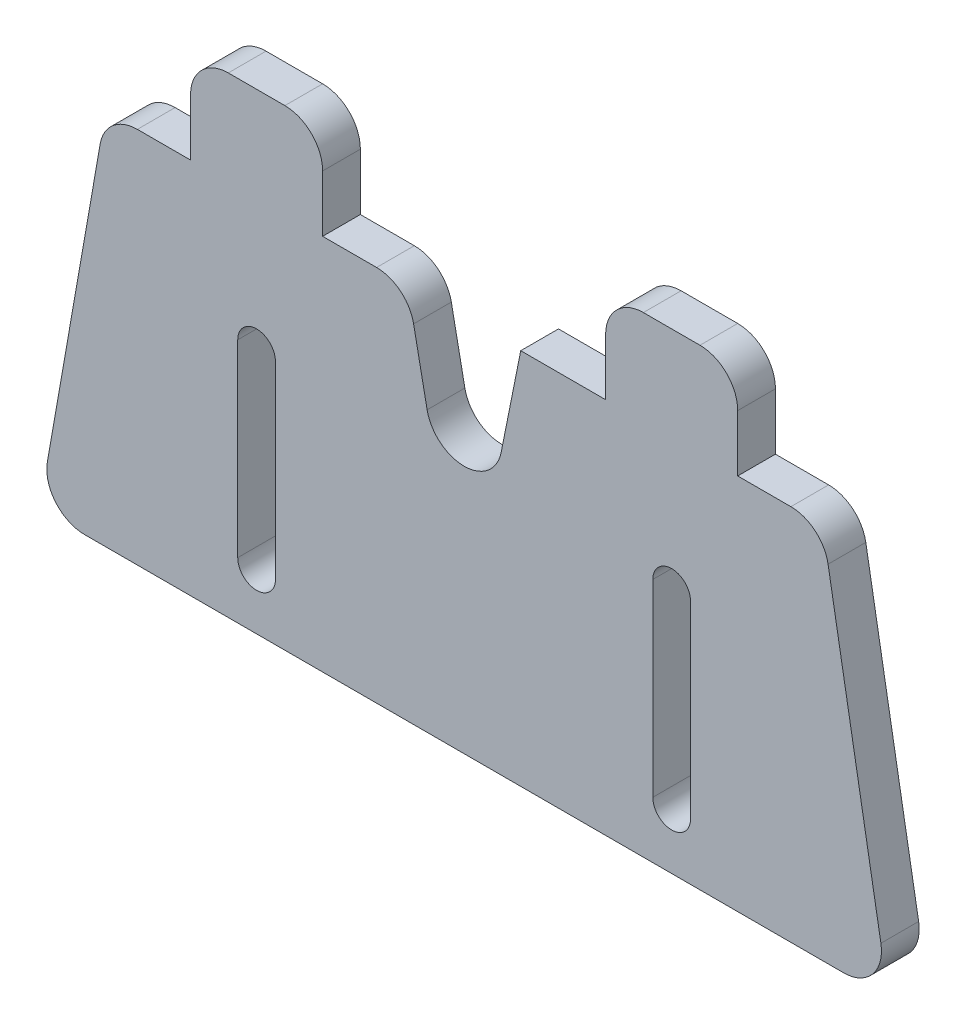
ISO-10303-21;
HEADER;
FILE_DESCRIPTION(('STEP AP214'),'2;1');
FILE_NAME('part.step','',(''),(''),'','','');
FILE_SCHEMA(('AUTOMOTIVE_DESIGN { 1 0 10303 214 1 1 1 1 }'));
ENDSEC;
DATA;
#1=APPLICATION_CONTEXT('core data for automotive mechanical design processes');
#2=APPLICATION_PROTOCOL_DEFINITION('international standard','automotive_design',2000,#1);
#3=PRODUCT_CONTEXT('',#1,'mechanical');
#4=PRODUCT('Part','Part','',(#3));
#5=PRODUCT_RELATED_PRODUCT_CATEGORY('part','',(#4));
#6=PRODUCT_DEFINITION_FORMATION('','',#4);
#7=PRODUCT_DEFINITION_CONTEXT('part definition',#1,'design');
#8=PRODUCT_DEFINITION('design','',#6,#7);
#9=PRODUCT_DEFINITION_SHAPE('','',#8);
#10=(LENGTH_UNIT() NAMED_UNIT(*) SI_UNIT(.MILLI.,.METRE.));
#11=(NAMED_UNIT(*) PLANE_ANGLE_UNIT() SI_UNIT($,.RADIAN.));
#12=(NAMED_UNIT(*) SI_UNIT($,.STERADIAN.) SOLID_ANGLE_UNIT());
#13=UNCERTAINTY_MEASURE_WITH_UNIT(LENGTH_MEASURE(1.E-05),#10,'distance_accuracy_value','');
#14=(GEOMETRIC_REPRESENTATION_CONTEXT(3) GLOBAL_UNCERTAINTY_ASSIGNED_CONTEXT((#13)) GLOBAL_UNIT_ASSIGNED_CONTEXT((#10,
#11,#12)) REPRESENTATION_CONTEXT('',''));
#15=CARTESIAN_POINT('',(0.,0.,0.));
#16=DIRECTION('',(0.,0.,1.));
#17=DIRECTION('',(1.,0.,0.));
#18=AXIS2_PLACEMENT_3D('',#15,#16,#17);
#19=CARTESIAN_POINT('',(12.,0.,2.));
#20=DIRECTION('',(1.,0.,0.));
#21=DIRECTION('',(0.,0.,-1.));
#22=AXIS2_PLACEMENT_3D('',#19,#20,#21);
#23=PLANE('',#22);
#24=DIRECTION('',(0.,-1.,0.));
#25=VECTOR('',#24,1.);
#26=CARTESIAN_POINT('',(12.,0.,0.));
#27=LINE('',#26,#25);
#28=CARTESIAN_POINT('',(12.,0.5,0.));
#29=VERTEX_POINT('',#28);
#30=CARTESIAN_POINT('',(12.,-9.5,0.));
#31=VERTEX_POINT('',#30);
#32=EDGE_CURVE('E381',#29,#31,#27,.T.);
#33=ORIENTED_EDGE('',*,*,#32,.T.);
#34=DIRECTION('',(0.,0.,-1.));
#35=VECTOR('',#34,1.);
#36=CARTESIAN_POINT('',(12.,-9.5,2.));
#37=LINE('',#36,#35);
#38=CARTESIAN_POINT('',(12.,-9.5,2.));
#39=VERTEX_POINT('',#38);
#40=EDGE_CURVE('E400',#39,#31,#37,.T.);
#41=ORIENTED_EDGE('',*,*,#40,.F.);
#42=DIRECTION('',(0.,-1.,0.));
#43=VECTOR('',#42,1.);
#44=CARTESIAN_POINT('',(12.,0.,2.));
#45=LINE('',#44,#43);
#46=CARTESIAN_POINT('',(12.,0.5,2.));
#47=VERTEX_POINT('',#46);
#48=EDGE_CURVE('E321',#47,#39,#45,.T.);
#49=ORIENTED_EDGE('',*,*,#48,.F.);
#50=DIRECTION('',(0.,0.,-1.));
#51=VECTOR('',#50,1.);
#52=CARTESIAN_POINT('',(12.,0.5,2.));
#53=LINE('',#52,#51);
#54=EDGE_CURVE('E392',#47,#29,#53,.T.);
#55=ORIENTED_EDGE('',*,*,#54,.T.);
#56=EDGE_LOOP('',(#33,#41,#49,#55));
#57=FACE_BOUND('',#56,.T.);
#58=ADVANCED_FACE('F34',(#57),#23,.F.);
#59=CARTESIAN_POINT('',(11.,-9.5,2.));
#60=DIRECTION('',(0.,0.,-1.));
#61=DIRECTION('',(-1.,0.,0.));
#62=AXIS2_PLACEMENT_3D('',#59,#60,#61);
#63=CYLINDRICAL_SURFACE('',#62,1.);
#64=CARTESIAN_POINT('',(11.,-9.5,0.));
#65=DIRECTION('',(0.,0.,1.));
#66=DIRECTION('',(1.,0.,0.));
#67=AXIS2_PLACEMENT_3D('',#64,#65,#66);
#68=CIRCLE('',#67,1.);
#69=CARTESIAN_POINT('',(10.,-9.5,0.));
#70=VERTEX_POINT('',#69);
#71=EDGE_CURVE('E384',#31,#70,#68,.F.);
#72=ORIENTED_EDGE('',*,*,#71,.T.);
#73=DIRECTION('',(0.,0.,-1.));
#74=VECTOR('',#73,1.);
#75=CARTESIAN_POINT('',(10.,-9.5,2.));
#76=LINE('',#75,#74);
#77=CARTESIAN_POINT('',(10.,-9.5,2.));
#78=VERTEX_POINT('',#77);
#79=EDGE_CURVE('E398',#78,#70,#76,.T.);
#80=ORIENTED_EDGE('',*,*,#79,.F.);
#81=CARTESIAN_POINT('',(11.,-9.5,2.));
#82=DIRECTION('',(0.,0.,1.));
#83=DIRECTION('',(1.,0.,0.));
#84=AXIS2_PLACEMENT_3D('',#81,#82,#83);
#85=CIRCLE('',#84,1.);
#86=EDGE_CURVE('E324',#39,#78,#85,.F.);
#87=ORIENTED_EDGE('',*,*,#86,.F.);
#88=ORIENTED_EDGE('',*,*,#40,.T.);
#89=EDGE_LOOP('',(#72,#80,#87,#88));
#90=FACE_BOUND('',#89,.T.);
#91=ADVANCED_FACE('F588',(#90),#63,.F.);
#92=CARTESIAN_POINT('',(10.,0.,2.));
#93=DIRECTION('',(1.,0.,0.));
#94=DIRECTION('',(0.,0.,-1.));
#95=AXIS2_PLACEMENT_3D('',#92,#93,#94);
#96=PLANE('',#95);
#97=DIRECTION('',(0.,-1.,0.));
#98=VECTOR('',#97,1.);
#99=CARTESIAN_POINT('',(10.,0.,0.));
#100=LINE('',#99,#98);
#101=CARTESIAN_POINT('',(10.,0.5,0.));
#102=VERTEX_POINT('',#101);
#103=EDGE_CURVE('E387',#102,#70,#100,.T.);
#104=ORIENTED_EDGE('',*,*,#103,.F.);
#105=DIRECTION('',(0.,0.,-1.));
#106=VECTOR('',#105,1.);
#107=CARTESIAN_POINT('',(10.,0.5,2.));
#108=LINE('',#107,#106);
#109=CARTESIAN_POINT('',(10.,0.5,2.));
#110=VERTEX_POINT('',#109);
#111=EDGE_CURVE('E395',#110,#102,#108,.T.);
#112=ORIENTED_EDGE('',*,*,#111,.F.);
#113=DIRECTION('',(0.,-1.,0.));
#114=VECTOR('',#113,1.);
#115=CARTESIAN_POINT('',(10.,0.,2.));
#116=LINE('',#115,#114);
#117=EDGE_CURVE('E326',#110,#78,#116,.T.);
#118=ORIENTED_EDGE('',*,*,#117,.T.);
#119=ORIENTED_EDGE('',*,*,#79,.T.);
#120=EDGE_LOOP('',(#104,#112,#118,#119));
#121=FACE_BOUND('',#120,.T.);
#122=ADVANCED_FACE('F594',(#121),#96,.T.);
#123=CARTESIAN_POINT('',(-11.,-9.5,2.));
#124=DIRECTION('',(0.,0.,-1.));
#125=DIRECTION('',(-1.,0.,0.));
#126=AXIS2_PLACEMENT_3D('',#123,#124,#125);
#127=CYLINDRICAL_SURFACE('',#126,1.);
#128=CARTESIAN_POINT('',(-11.,-9.5,0.));
#129=DIRECTION('',(0.,0.,1.));
#130=DIRECTION('',(1.,0.,0.));
#131=AXIS2_PLACEMENT_3D('',#128,#129,#130);
#132=CIRCLE('',#131,1.);
#133=CARTESIAN_POINT('',(-12.,-9.5,0.));
#134=VERTEX_POINT('',#133);
#135=CARTESIAN_POINT('',(-10.,-9.5,0.));
#136=VERTEX_POINT('',#135);
#137=EDGE_CURVE('E369',#134,#136,#132,.T.);
#138=ORIENTED_EDGE('',*,*,#137,.F.);
#139=DIRECTION('',(0.,0.,-1.));
#140=VECTOR('',#139,1.);
#141=CARTESIAN_POINT('',(-12.,-9.5,2.));
#142=LINE('',#141,#140);
#143=CARTESIAN_POINT('',(-12.,-9.5,2.));
#144=VERTEX_POINT('',#143);
#145=EDGE_CURVE('E396',#144,#134,#142,.T.);
#146=ORIENTED_EDGE('',*,*,#145,.F.);
#147=CARTESIAN_POINT('',(-11.,-9.5,2.));
#148=DIRECTION('',(0.,0.,1.));
#149=DIRECTION('',(1.,0.,0.));
#150=AXIS2_PLACEMENT_3D('',#147,#148,#149);
#151=CIRCLE('',#150,1.);
#152=CARTESIAN_POINT('',(-10.,-9.5,2.));
#153=VERTEX_POINT('',#152);
#154=EDGE_CURVE('E310',#144,#153,#151,.T.);
#155=ORIENTED_EDGE('',*,*,#154,.T.);
#156=DIRECTION('',(0.,0.,-1.));
#157=VECTOR('',#156,1.);
#158=CARTESIAN_POINT('',(-10.,-9.5,2.));
#159=LINE('',#158,#157);
#160=EDGE_CURVE('E262',#153,#136,#159,.T.);
#161=ORIENTED_EDGE('',*,*,#160,.T.);
#162=EDGE_LOOP('',(#138,#146,#155,#161));
#163=FACE_BOUND('',#162,.T.);
#164=ADVANCED_FACE('F611',(#163),#127,.F.);
#165=CARTESIAN_POINT('',(-12.,0.,2.));
#166=DIRECTION('',(1.,0.,0.));
#167=DIRECTION('',(0.,0.,-1.));
#168=AXIS2_PLACEMENT_3D('',#165,#166,#167);
#169=PLANE('',#168);
#170=DIRECTION('',(0.,-1.,0.));
#171=VECTOR('',#170,1.);
#172=CARTESIAN_POINT('',(-12.,0.,0.));
#173=LINE('',#172,#171);
#174=CARTESIAN_POINT('',(-12.,0.5,0.));
#175=VERTEX_POINT('',#174);
#176=EDGE_CURVE('E372',#175,#134,#173,.T.);
#177=ORIENTED_EDGE('',*,*,#176,.F.);
#178=DIRECTION('',(0.,0.,-1.));
#179=VECTOR('',#178,1.);
#180=CARTESIAN_POINT('',(-12.,0.5,2.));
#181=LINE('',#180,#179);
#182=CARTESIAN_POINT('',(-12.,0.5,2.));
#183=VERTEX_POINT('',#182);
#184=EDGE_CURVE('E407',#183,#175,#181,.T.);
#185=ORIENTED_EDGE('',*,*,#184,.F.);
#186=DIRECTION('',(0.,-1.,0.));
#187=VECTOR('',#186,1.);
#188=CARTESIAN_POINT('',(-12.,0.,2.));
#189=LINE('',#188,#187);
#190=EDGE_CURVE('E313',#183,#144,#189,.T.);
#191=ORIENTED_EDGE('',*,*,#190,.T.);
#192=ORIENTED_EDGE('',*,*,#145,.T.);
#193=EDGE_LOOP('',(#177,#185,#191,#192));
#194=FACE_BOUND('',#193,.T.);
#195=ADVANCED_FACE('F607',(#194),#169,.T.);
#196=CARTESIAN_POINT('',(-11.,0.5,2.));
#197=DIRECTION('',(0.,0.,-1.));
#198=DIRECTION('',(-1.,0.,0.));
#199=AXIS2_PLACEMENT_3D('',#196,#197,#198);
#200=CYLINDRICAL_SURFACE('',#199,1.);
#201=CARTESIAN_POINT('',(-11.,0.5,0.));
#202=DIRECTION('',(0.,0.,1.));
#203=DIRECTION('',(1.,0.,0.));
#204=AXIS2_PLACEMENT_3D('',#201,#202,#203);
#205=CIRCLE('',#204,1.);
#206=CARTESIAN_POINT('',(-10.,0.5,0.));
#207=VERTEX_POINT('',#206);
#208=EDGE_CURVE('E375',#207,#175,#205,.T.);
#209=ORIENTED_EDGE('',*,*,#208,.F.);
#210=DIRECTION('',(0.,0.,-1.));
#211=VECTOR('',#210,1.);
#212=CARTESIAN_POINT('',(-10.,0.5,2.));
#213=LINE('',#212,#211);
#214=CARTESIAN_POINT('',(-10.,0.5,2.));
#215=VERTEX_POINT('',#214);
#216=EDGE_CURVE('E405',#215,#207,#213,.T.);
#217=ORIENTED_EDGE('',*,*,#216,.F.);
#218=CARTESIAN_POINT('',(-11.,0.5,2.));
#219=DIRECTION('',(0.,0.,1.));
#220=DIRECTION('',(1.,0.,0.));
#221=AXIS2_PLACEMENT_3D('',#218,#219,#220);
#222=CIRCLE('',#221,1.);
#223=EDGE_CURVE('E316',#215,#183,#222,.T.);
#224=ORIENTED_EDGE('',*,*,#223,.T.);
#225=ORIENTED_EDGE('',*,*,#184,.T.);
#226=EDGE_LOOP('',(#209,#217,#224,#225));
#227=FACE_BOUND('',#226,.T.);
#228=ADVANCED_FACE('F604',(#227),#200,.F.);
#229=CARTESIAN_POINT('',(0.,-12.5,2.));
#230=DIRECTION('',(0.,1.,0.));
#231=DIRECTION('',(0.,0.,1.));
#232=AXIS2_PLACEMENT_3D('',#229,#230,#231);
#233=PLANE('',#232);
#234=DIRECTION('',(1.,0.,0.));
#235=VECTOR('',#234,1.);
#236=CARTESIAN_POINT('',(0.,-12.5,0.));
#237=LINE('',#236,#235);
#238=CARTESIAN_POINT('',(-20.1196059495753,-12.5,0.));
#239=VERTEX_POINT('',#238);
#240=CARTESIAN_POINT('',(20.1196059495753,-12.5,0.));
#241=VERTEX_POINT('',#240);
#242=EDGE_CURVE('E332',#239,#241,#237,.T.);
#243=ORIENTED_EDGE('',*,*,#242,.T.);
#244=DIRECTION('',(0.,0.,-1.));
#245=VECTOR('',#244,1.);
#246=CARTESIAN_POINT('',(20.1196059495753,-12.5,2.));
#247=LINE('',#246,#245);
#248=CARTESIAN_POINT('',(20.1196059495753,-12.5,2.));
#249=VERTEX_POINT('',#248);
#250=EDGE_CURVE('E444',#241,#249,#247,.F.);
#251=ORIENTED_EDGE('',*,*,#250,.T.);
#252=DIRECTION('',(1.,0.,0.));
#253=VECTOR('',#252,1.);
#254=CARTESIAN_POINT('',(0.,-12.5,2.));
#255=LINE('',#254,#253);
#256=CARTESIAN_POINT('',(-20.1196059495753,-12.5,2.));
#257=VERTEX_POINT('',#256);
#258=EDGE_CURVE('E281',#257,#249,#255,.T.);
#259=ORIENTED_EDGE('',*,*,#258,.F.);
#260=DIRECTION('',(0.,0.,-1.));
#261=VECTOR('',#260,1.);
#262=CARTESIAN_POINT('',(-20.1196059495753,-12.5,0.));
#263=LINE('',#262,#261);
#264=EDGE_CURVE('E441',#257,#239,#263,.T.);
#265=ORIENTED_EDGE('',*,*,#264,.T.);
#266=EDGE_LOOP('',(#243,#251,#259,#265));
#267=FACE_BOUND('',#266,.T.);
#268=ADVANCED_FACE('F564',(#267),#233,.F.);
#269=CARTESIAN_POINT('',(19.7089144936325,3.44906003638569,2.));
#270=DIRECTION('',(-0.985030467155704,-0.172380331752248,0.));
#271=DIRECTION('',(0.172380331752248,-0.985030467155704,0.));
#272=AXIS2_PLACEMENT_3D('',#269,#270,#271);
#273=PLANE('',#272);
#274=DIRECTION('',(-0.172380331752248,0.985030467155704,0.));
#275=VECTOR('',#274,1.);
#276=CARTESIAN_POINT('',(19.7089144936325,3.44906003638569,2.));
#277=LINE('',#276,#275);
#278=CARTESIAN_POINT('',(22.0896668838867,-10.1552393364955,2.));
#279=VERTEX_POINT('',#278);
#280=CARTESIAN_POINT('',(19.2896668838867,5.8447606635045,2.));
#281=VERTEX_POINT('',#280);
#282=EDGE_CURVE('E279',#279,#281,#277,.T.);
#283=ORIENTED_EDGE('',*,*,#282,.F.);
#284=DIRECTION('',(0.,0.,-1.));
#285=VECTOR('',#284,1.);
#286=CARTESIAN_POINT('',(22.0896668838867,-10.1552393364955,2.));
#287=LINE('',#286,#285);
#288=CARTESIAN_POINT('',(22.0896668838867,-10.1552393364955,0.));
#289=VERTEX_POINT('',#288);
#290=EDGE_CURVE('E420',#279,#289,#287,.T.);
#291=ORIENTED_EDGE('',*,*,#290,.T.);
#292=DIRECTION('',(-0.172380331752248,0.985030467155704,0.));
#293=VECTOR('',#292,1.);
#294=CARTESIAN_POINT('',(19.7089144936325,3.44906003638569,0.));
#295=LINE('',#294,#293);
#296=CARTESIAN_POINT('',(19.2896668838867,5.8447606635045,0.));
#297=VERTEX_POINT('',#296);
#298=EDGE_CURVE('E335',#289,#297,#295,.T.);
#299=ORIENTED_EDGE('',*,*,#298,.T.);
#300=DIRECTION('',(0.,0.,-1.));
#301=VECTOR('',#300,1.);
#302=CARTESIAN_POINT('',(19.2896668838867,5.8447606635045,2.));
#303=LINE('',#302,#301);
#304=EDGE_CURVE('E403',#297,#281,#303,.F.);
#305=ORIENTED_EDGE('',*,*,#304,.T.);
#306=EDGE_LOOP('',(#283,#291,#299,#305));
#307=FACE_BOUND('',#306,.T.);
#308=ADVANCED_FACE('F572',(#307),#273,.F.);
#309=CARTESIAN_POINT('',(0.,7.5,2.));
#310=DIRECTION('',(0.,1.,0.));
#311=DIRECTION('',(-1.,0.,0.));
#312=AXIS2_PLACEMENT_3D('',#309,#310,#311);
#313=PLANE('',#312);
#314=DIRECTION('',(1.,0.,0.));
#315=VECTOR('',#314,1.);
#316=CARTESIAN_POINT('',(0.,7.5,2.));
#317=LINE('',#316,#315);
#318=CARTESIAN_POINT('',(14.5,7.5,2.));
#319=VERTEX_POINT('',#318);
#320=CARTESIAN_POINT('',(17.3196059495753,7.5,2.));
#321=VERTEX_POINT('',#320);
#322=EDGE_CURVE('E255',#319,#321,#317,.T.);
#323=ORIENTED_EDGE('',*,*,#322,.T.);
#324=DIRECTION('',(0.,0.,-1.));
#325=VECTOR('',#324,1.);
#326=CARTESIAN_POINT('',(17.3196059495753,7.5,0.));
#327=LINE('',#326,#325);
#328=CARTESIAN_POINT('',(17.3196059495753,7.5,0.));
#329=VERTEX_POINT('',#328);
#330=EDGE_CURVE('E478',#321,#329,#327,.T.);
#331=ORIENTED_EDGE('',*,*,#330,.T.);
#332=DIRECTION('',(1.,0.,0.));
#333=VECTOR('',#332,1.);
#334=CARTESIAN_POINT('',(0.,7.5,0.));
#335=LINE('',#334,#333);
#336=CARTESIAN_POINT('',(14.5,7.5,0.));
#337=VERTEX_POINT('',#336);
#338=EDGE_CURVE('E258',#337,#329,#335,.T.);
#339=ORIENTED_EDGE('',*,*,#338,.F.);
#340=DIRECTION('',(0.,0.,-1.));
#341=VECTOR('',#340,1.);
#342=CARTESIAN_POINT('',(14.5,7.5,2.));
#343=LINE('',#342,#341);
#344=EDGE_CURVE('E250',#319,#337,#343,.T.);
#345=ORIENTED_EDGE('',*,*,#344,.F.);
#346=EDGE_LOOP('',(#323,#331,#339,#345));
#347=FACE_BOUND('',#346,.T.);
#348=ADVANCED_FACE('F252',(#347),#313,.T.);
#349=CARTESIAN_POINT('',(14.5,0.,2.));
#350=DIRECTION('',(-1.,0.,0.));
#351=DIRECTION('',(0.,0.,1.));
#352=AXIS2_PLACEMENT_3D('',#349,#350,#351);
#353=PLANE('',#352);
#354=DIRECTION('',(0.,1.,0.));
#355=VECTOR('',#354,1.);
#356=CARTESIAN_POINT('',(14.5,0.,0.));
#357=LINE('',#356,#355);
#358=CARTESIAN_POINT('',(14.5,10.5,0.));
#359=VERTEX_POINT('',#358);
#360=EDGE_CURVE('E339',#337,#359,#357,.T.);
#361=ORIENTED_EDGE('',*,*,#360,.T.);
#362=DIRECTION('',(0.,0.,-1.));
#363=VECTOR('',#362,1.);
#364=CARTESIAN_POINT('',(14.5,10.5,2.));
#365=LINE('',#364,#363);
#366=CARTESIAN_POINT('',(14.5,10.5,2.));
#367=VERTEX_POINT('',#366);
#368=EDGE_CURVE('E269',#359,#367,#365,.F.);
#369=ORIENTED_EDGE('',*,*,#368,.T.);
#370=DIRECTION('',(0.,1.,0.));
#371=VECTOR('',#370,1.);
#372=CARTESIAN_POINT('',(14.5,0.,2.));
#373=LINE('',#372,#371);
#374=EDGE_CURVE('E266',#319,#367,#373,.T.);
#375=ORIENTED_EDGE('',*,*,#374,.F.);
#376=ORIENTED_EDGE('',*,*,#344,.T.);
#377=EDGE_LOOP('',(#361,#369,#375,#376));
#378=FACE_BOUND('',#377,.T.);
#379=ADVANCED_FACE('F267',(#378),#353,.F.);
#380=CARTESIAN_POINT('',(0.,12.5,2.));
#381=DIRECTION('',(0.,1.,0.));
#382=DIRECTION('',(0.,0.,1.));
#383=AXIS2_PLACEMENT_3D('',#380,#381,#382);
#384=PLANE('',#383);
#385=DIRECTION('',(1.,0.,0.));
#386=VECTOR('',#385,1.);
#387=CARTESIAN_POINT('',(0.,12.5,2.));
#388=LINE('',#387,#386);
#389=CARTESIAN_POINT('',(9.5,12.5,2.));
#390=VERTEX_POINT('',#389);
#391=CARTESIAN_POINT('',(12.5,12.5,2.));
#392=VERTEX_POINT('',#391);
#393=EDGE_CURVE('E271',#390,#392,#388,.T.);
#394=ORIENTED_EDGE('',*,*,#393,.T.);
#395=DIRECTION('',(0.,0.,-1.));
#396=VECTOR('',#395,1.);
#397=CARTESIAN_POINT('',(12.5,12.5,0.));
#398=LINE('',#397,#396);
#399=CARTESIAN_POINT('',(12.5,12.5,0.));
#400=VERTEX_POINT('',#399);
#401=EDGE_CURVE('E482',#392,#400,#398,.T.);
#402=ORIENTED_EDGE('',*,*,#401,.T.);
#403=DIRECTION('',(1.,0.,0.));
#404=VECTOR('',#403,1.);
#405=CARTESIAN_POINT('',(0.,12.5,0.));
#406=LINE('',#405,#404);
#407=CARTESIAN_POINT('',(9.5,12.5,0.));
#408=VERTEX_POINT('',#407);
#409=EDGE_CURVE('E341',#408,#400,#406,.T.);
#410=ORIENTED_EDGE('',*,*,#409,.F.);
#411=DIRECTION('',(0.,0.,-1.));
#412=VECTOR('',#411,1.);
#413=CARTESIAN_POINT('',(9.5,12.5,2.));
#414=LINE('',#413,#412);
#415=EDGE_CURVE('E480',#408,#390,#414,.F.);
#416=ORIENTED_EDGE('',*,*,#415,.T.);
#417=EDGE_LOOP('',(#394,#402,#410,#416));
#418=FACE_BOUND('',#417,.T.);
#419=ADVANCED_FACE('F625',(#418),#384,.T.);
#420=CARTESIAN_POINT('',(7.5,0.,2.));
#421=DIRECTION('',(1.,0.,0.));
#422=DIRECTION('',(0.,0.,-1.));
#423=AXIS2_PLACEMENT_3D('',#420,#421,#422);
#424=PLANE('',#423);
#425=DIRECTION('',(0.,-1.,0.));
#426=VECTOR('',#425,1.);
#427=CARTESIAN_POINT('',(7.5,0.,2.));
#428=LINE('',#427,#426);
#429=CARTESIAN_POINT('',(7.5,10.5,2.));
#430=VERTEX_POINT('',#429);
#431=CARTESIAN_POINT('',(7.5,7.5,2.));
#432=VERTEX_POINT('',#431);
#433=EDGE_CURVE('E290',#430,#432,#428,.T.);
#434=ORIENTED_EDGE('',*,*,#433,.F.);
#435=DIRECTION('',(0.,0.,-1.));
#436=VECTOR('',#435,1.);
#437=CARTESIAN_POINT('',(7.5,10.5,0.));
#438=LINE('',#437,#436);
#439=CARTESIAN_POINT('',(7.5,10.5,0.));
#440=VERTEX_POINT('',#439);
#441=EDGE_CURVE('E486',#430,#440,#438,.T.);
#442=ORIENTED_EDGE('',*,*,#441,.T.);
#443=DIRECTION('',(0.,-1.,0.));
#444=VECTOR('',#443,1.);
#445=CARTESIAN_POINT('',(7.5,0.,0.));
#446=LINE('',#445,#444);
#447=CARTESIAN_POINT('',(7.5,7.5,0.));
#448=VERTEX_POINT('',#447);
#449=EDGE_CURVE('E344',#440,#448,#446,.T.);
#450=ORIENTED_EDGE('',*,*,#449,.T.);
#451=DIRECTION('',(0.,0.,-1.));
#452=VECTOR('',#451,1.);
#453=CARTESIAN_POINT('',(7.5,7.5,2.));
#454=LINE('',#453,#452);
#455=EDGE_CURVE('E263',#432,#448,#454,.T.);
#456=ORIENTED_EDGE('',*,*,#455,.F.);
#457=EDGE_LOOP('',(#434,#442,#450,#456));
#458=FACE_BOUND('',#457,.T.);
#459=ADVANCED_FACE('F637',(#458),#424,.F.);
#460=CARTESIAN_POINT('',(0.,7.5,2.));
#461=DIRECTION('',(0.,-1.,0.));
#462=DIRECTION('',(1.,0.,0.));
#463=AXIS2_PLACEMENT_3D('',#460,#461,#462);
#464=PLANE('',#463);
#465=DIRECTION('',(-1.,0.,0.));
#466=VECTOR('',#465,1.);
#467=CARTESIAN_POINT('',(0.,7.5,0.));
#468=LINE('',#467,#466);
#469=CARTESIAN_POINT('',(3.,7.5,0.));
#470=VERTEX_POINT('',#469);
#471=EDGE_CURVE('E347',#448,#470,#468,.T.);
#472=ORIENTED_EDGE('',*,*,#471,.T.);
#473=DIRECTION('',(0.,0.,-1.));
#474=VECTOR('',#473,1.);
#475=CARTESIAN_POINT('',(3.,7.5,2.));
#476=LINE('',#475,#474);
#477=CARTESIAN_POINT('',(3.,7.5,2.));
#478=VERTEX_POINT('',#477);
#479=EDGE_CURVE('E414',#478,#470,#476,.T.);
#480=ORIENTED_EDGE('',*,*,#479,.F.);
#481=DIRECTION('',(-1.,0.,0.));
#482=VECTOR('',#481,1.);
#483=CARTESIAN_POINT('',(0.,7.5,2.));
#484=LINE('',#483,#482);
#485=EDGE_CURVE('E292',#432,#478,#484,.T.);
#486=ORIENTED_EDGE('',*,*,#485,.F.);
#487=ORIENTED_EDGE('',*,*,#455,.T.);
#488=EDGE_LOOP('',(#472,#480,#486,#487));
#489=FACE_BOUND('',#488,.T.);
#490=ADVANCED_FACE('F634',(#489),#464,.F.);
#491=CARTESIAN_POINT('',(1.44230769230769,-0.288461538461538,2.));
#492=DIRECTION('',(0.98058067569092,-0.196116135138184,0.));
#493=DIRECTION('',(0.196116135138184,0.98058067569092,0.));
#494=AXIS2_PLACEMENT_3D('',#491,#492,#493);
#495=PLANE('',#494);
#496=DIRECTION('',(-0.196116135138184,-0.98058067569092,0.));
#497=VECTOR('',#496,1.);
#498=CARTESIAN_POINT('',(1.44230769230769,-0.288461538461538,0.));
#499=LINE('',#498,#497);
#500=CARTESIAN_POINT('',(1.96116135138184,2.3058067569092,0.));
#501=VERTEX_POINT('',#500);
#502=EDGE_CURVE('E349',#470,#501,#499,.T.);
#503=ORIENTED_EDGE('',*,*,#502,.T.);
#504=DIRECTION('',(0.,0.,-1.));
#505=VECTOR('',#504,1.);
#506=CARTESIAN_POINT('',(1.96116135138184,2.3058067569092,2.));
#507=LINE('',#506,#505);
#508=CARTESIAN_POINT('',(1.96116135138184,2.3058067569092,2.));
#509=VERTEX_POINT('',#508);
#510=EDGE_CURVE('E471',#501,#509,#507,.F.);
#511=ORIENTED_EDGE('',*,*,#510,.T.);
#512=DIRECTION('',(-0.196116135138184,-0.98058067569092,0.));
#513=VECTOR('',#512,1.);
#514=CARTESIAN_POINT('',(1.44230769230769,-0.288461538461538,2.));
#515=LINE('',#514,#513);
#516=EDGE_CURVE('E294',#478,#509,#515,.T.);
#517=ORIENTED_EDGE('',*,*,#516,.F.);
#518=ORIENTED_EDGE('',*,*,#479,.T.);
#519=EDGE_LOOP('',(#503,#511,#517,#518));
#520=FACE_BOUND('',#519,.T.);
#521=ADVANCED_FACE('F509',(#520),#495,.F.);
#522=CARTESIAN_POINT('',(-1.44230769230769,-0.288461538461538,2.));
#523=DIRECTION('',(0.98058067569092,0.196116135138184,0.));
#524=DIRECTION('',(-0.196116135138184,0.98058067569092,0.));
#525=AXIS2_PLACEMENT_3D('',#522,#523,#524);
#526=PLANE('',#525);
#527=DIRECTION('',(0.196116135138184,-0.98058067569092,0.));
#528=VECTOR('',#527,1.);
#529=CARTESIAN_POINT('',(-1.44230769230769,-0.288461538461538,2.));
#530=LINE('',#529,#528);
#531=CARTESIAN_POINT('',(-2.67844645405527,5.89223227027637,2.));
#532=VERTEX_POINT('',#531);
#533=CARTESIAN_POINT('',(-1.96116135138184,2.3058067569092,2.));
#534=VERTEX_POINT('',#533);
#535=EDGE_CURVE('E297',#532,#534,#530,.T.);
#536=ORIENTED_EDGE('',*,*,#535,.T.);
#537=DIRECTION('',(0.,0.,-1.));
#538=VECTOR('',#537,1.);
#539=CARTESIAN_POINT('',(-1.96116135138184,2.3058067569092,2.));
#540=LINE('',#539,#538);
#541=CARTESIAN_POINT('',(-1.96116135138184,2.3058067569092,0.));
#542=VERTEX_POINT('',#541);
#543=EDGE_CURVE('E468',#534,#542,#540,.T.);
#544=ORIENTED_EDGE('',*,*,#543,.T.);
#545=DIRECTION('',(0.196116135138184,-0.98058067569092,0.));
#546=VECTOR('',#545,1.);
#547=CARTESIAN_POINT('',(-1.44230769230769,-0.288461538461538,0.));
#548=LINE('',#547,#546);
#549=CARTESIAN_POINT('',(-2.67844645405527,5.89223227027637,0.));
#550=VERTEX_POINT('',#549);
#551=EDGE_CURVE('E352',#550,#542,#548,.T.);
#552=ORIENTED_EDGE('',*,*,#551,.F.);
#553=DIRECTION('',(0.,0.,-1.));
#554=VECTOR('',#553,1.);
#555=CARTESIAN_POINT('',(-2.67844645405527,5.89223227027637,2.));
#556=LINE('',#555,#554);
#557=EDGE_CURVE('E466',#550,#532,#556,.F.);
#558=ORIENTED_EDGE('',*,*,#557,.T.);
#559=EDGE_LOOP('',(#536,#544,#552,#558));
#560=FACE_BOUND('',#559,.T.);
#561=ADVANCED_FACE('F517',(#560),#526,.T.);
#562=CARTESIAN_POINT('',(0.,7.5,2.));
#563=DIRECTION('',(0.,1.,0.));
#564=DIRECTION('',(-1.,0.,0.));
#565=AXIS2_PLACEMENT_3D('',#562,#563,#564);
#566=PLANE('',#565);
#567=DIRECTION('',(1.,0.,0.));
#568=VECTOR('',#567,1.);
#569=CARTESIAN_POINT('',(0.,7.5,2.));
#570=LINE('',#569,#568);
#571=CARTESIAN_POINT('',(-7.5,7.5,2.));
#572=VERTEX_POINT('',#571);
#573=CARTESIAN_POINT('',(-4.63960780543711,7.5,2.));
#574=VERTEX_POINT('',#573);
#575=EDGE_CURVE('E300',#572,#574,#570,.T.);
#576=ORIENTED_EDGE('',*,*,#575,.T.);
#577=DIRECTION('',(0.,0.,-1.));
#578=VECTOR('',#577,1.);
#579=CARTESIAN_POINT('',(-4.63960780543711,7.5,2.));
#580=LINE('',#579,#578);
#581=CARTESIAN_POINT('',(-4.63960780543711,7.5,0.));
#582=VERTEX_POINT('',#581);
#583=EDGE_CURVE('E475',#574,#582,#580,.T.);
#584=ORIENTED_EDGE('',*,*,#583,.T.);
#585=DIRECTION('',(1.,0.,0.));
#586=VECTOR('',#585,1.);
#587=CARTESIAN_POINT('',(0.,7.5,0.));
#588=LINE('',#587,#586);
#589=CARTESIAN_POINT('',(-7.5,7.5,0.));
#590=VERTEX_POINT('',#589);
#591=EDGE_CURVE('E355',#590,#582,#588,.T.);
#592=ORIENTED_EDGE('',*,*,#591,.F.);
#593=DIRECTION('',(0.,0.,-1.));
#594=VECTOR('',#593,1.);
#595=CARTESIAN_POINT('',(-7.5,7.5,2.));
#596=LINE('',#595,#594);
#597=EDGE_CURVE('E411',#572,#590,#596,.T.);
#598=ORIENTED_EDGE('',*,*,#597,.F.);
#599=EDGE_LOOP('',(#576,#584,#592,#598));
#600=FACE_BOUND('',#599,.T.);
#601=ADVANCED_FACE('F526',(#600),#566,.T.);
#602=CARTESIAN_POINT('',(-7.5,0.,2.));
#603=DIRECTION('',(1.,0.,0.));
#604=DIRECTION('',(0.,0.,-1.));
#605=AXIS2_PLACEMENT_3D('',#602,#603,#604);
#606=PLANE('',#605);
#607=DIRECTION('',(0.,-1.,0.));
#608=VECTOR('',#607,1.);
#609=CARTESIAN_POINT('',(-7.5,0.,0.));
#610=LINE('',#609,#608);
#611=CARTESIAN_POINT('',(-7.5,10.5,0.));
#612=VERTEX_POINT('',#611);
#613=EDGE_CURVE('E358',#612,#590,#610,.T.);
#614=ORIENTED_EDGE('',*,*,#613,.F.);
#615=DIRECTION('',(0.,0.,-1.));
#616=VECTOR('',#615,1.);
#617=CARTESIAN_POINT('',(-7.5,10.5,2.));
#618=LINE('',#617,#616);
#619=CARTESIAN_POINT('',(-7.5,10.5,2.));
#620=VERTEX_POINT('',#619);
#621=EDGE_CURVE('E497',#612,#620,#618,.F.);
#622=ORIENTED_EDGE('',*,*,#621,.T.);
#623=DIRECTION('',(0.,-1.,0.));
#624=VECTOR('',#623,1.);
#625=CARTESIAN_POINT('',(-7.5,0.,2.));
#626=LINE('',#625,#624);
#627=EDGE_CURVE('E289',#620,#572,#626,.T.);
#628=ORIENTED_EDGE('',*,*,#627,.T.);
#629=ORIENTED_EDGE('',*,*,#597,.T.);
#630=EDGE_LOOP('',(#614,#622,#628,#629));
#631=FACE_BOUND('',#630,.T.);
#632=ADVANCED_FACE('F530',(#631),#606,.T.);
#633=CARTESIAN_POINT('',(-12.5,12.5,0.));
#634=VERTEX_POINT('',#633);
#635=CARTESIAN_POINT('',(-9.5,12.5,0.));
#636=VERTEX_POINT('',#635);
#637=EDGE_CURVE('E345',#634,#636,#406,.T.);
#638=ORIENTED_EDGE('',*,*,#637,.F.);
#639=DIRECTION('',(0.,0.,-1.));
#640=VECTOR('',#639,1.);
#641=CARTESIAN_POINT('',(-12.5,12.5,2.));
#642=LINE('',#641,#640);
#643=CARTESIAN_POINT('',(-12.5,12.5,2.));
#644=VERTEX_POINT('',#643);
#645=EDGE_CURVE('E495',#634,#644,#642,.F.);
#646=ORIENTED_EDGE('',*,*,#645,.T.);
#647=CARTESIAN_POINT('',(-9.5,12.5,2.));
#648=VERTEX_POINT('',#647);
#649=EDGE_CURVE('E285',#644,#648,#388,.T.);
#650=ORIENTED_EDGE('',*,*,#649,.T.);
#651=DIRECTION('',(0.,0.,-1.));
#652=VECTOR('',#651,1.);
#653=CARTESIAN_POINT('',(-9.5,12.5,2.));
#654=LINE('',#653,#652);
#655=EDGE_CURVE('E492',#648,#636,#654,.T.);
#656=ORIENTED_EDGE('',*,*,#655,.T.);
#657=EDGE_LOOP('',(#638,#646,#650,#656));
#658=FACE_BOUND('',#657,.T.);
#659=ADVANCED_FACE('F539',(#658),#384,.T.);
#660=CARTESIAN_POINT('',(-14.5,0.,2.));
#661=DIRECTION('',(-1.,0.,0.));
#662=DIRECTION('',(0.,0.,1.));
#663=AXIS2_PLACEMENT_3D('',#660,#661,#662);
#664=PLANE('',#663);
#665=DIRECTION('',(0.,1.,0.));
#666=VECTOR('',#665,1.);
#667=CARTESIAN_POINT('',(-14.5,0.,2.));
#668=LINE('',#667,#666);
#669=CARTESIAN_POINT('',(-14.5,7.5,2.));
#670=VERTEX_POINT('',#669);
#671=CARTESIAN_POINT('',(-14.5,10.5,2.));
#672=VERTEX_POINT('',#671);
#673=EDGE_CURVE('E288',#670,#672,#668,.T.);
#674=ORIENTED_EDGE('',*,*,#673,.T.);
#675=DIRECTION('',(0.,0.,-1.));
#676=VECTOR('',#675,1.);
#677=CARTESIAN_POINT('',(-14.5,10.5,2.));
#678=LINE('',#677,#676);
#679=CARTESIAN_POINT('',(-14.5,10.5,0.));
#680=VERTEX_POINT('',#679);
#681=EDGE_CURVE('E489',#672,#680,#678,.T.);
#682=ORIENTED_EDGE('',*,*,#681,.T.);
#683=DIRECTION('',(0.,1.,0.));
#684=VECTOR('',#683,1.);
#685=CARTESIAN_POINT('',(-14.5,0.,0.));
#686=LINE('',#685,#684);
#687=CARTESIAN_POINT('',(-14.5,7.5,0.));
#688=VERTEX_POINT('',#687);
#689=EDGE_CURVE('E360',#688,#680,#686,.T.);
#690=ORIENTED_EDGE('',*,*,#689,.F.);
#691=DIRECTION('',(0.,0.,-1.));
#692=VECTOR('',#691,1.);
#693=CARTESIAN_POINT('',(-14.5,7.5,2.));
#694=LINE('',#693,#692);
#695=EDGE_CURVE('E331',#670,#688,#694,.T.);
#696=ORIENTED_EDGE('',*,*,#695,.F.);
#697=EDGE_LOOP('',(#674,#682,#690,#696));
#698=FACE_BOUND('',#697,.T.);
#699=ADVANCED_FACE('F548',(#698),#664,.T.);
#700=CARTESIAN_POINT('',(0.,7.5,2.));
#701=DIRECTION('',(0.,-1.,0.));
#702=DIRECTION('',(1.,0.,0.));
#703=AXIS2_PLACEMENT_3D('',#700,#701,#702);
#704=PLANE('',#703);
#705=DIRECTION('',(-1.,0.,0.));
#706=VECTOR('',#705,1.);
#707=CARTESIAN_POINT('',(0.,7.5,0.));
#708=LINE('',#707,#706);
#709=CARTESIAN_POINT('',(-17.3196059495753,7.5,0.));
#710=VERTEX_POINT('',#709);
#711=EDGE_CURVE('E363',#688,#710,#708,.T.);
#712=ORIENTED_EDGE('',*,*,#711,.T.);
#713=DIRECTION('',(0.,0.,-1.));
#714=VECTOR('',#713,1.);
#715=CARTESIAN_POINT('',(-17.3196059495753,7.5,2.));
#716=LINE('',#715,#714);
#717=CARTESIAN_POINT('',(-17.3196059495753,7.5,2.));
#718=VERTEX_POINT('',#717);
#719=EDGE_CURVE('E473',#710,#718,#716,.F.);
#720=ORIENTED_EDGE('',*,*,#719,.T.);
#721=DIRECTION('',(-1.,0.,0.));
#722=VECTOR('',#721,1.);
#723=CARTESIAN_POINT('',(0.,7.5,2.));
#724=LINE('',#723,#722);
#725=EDGE_CURVE('E306',#670,#718,#724,.T.);
#726=ORIENTED_EDGE('',*,*,#725,.F.);
#727=ORIENTED_EDGE('',*,*,#695,.T.);
#728=EDGE_LOOP('',(#712,#720,#726,#727));
#729=FACE_BOUND('',#728,.T.);
#730=ADVANCED_FACE('F602',(#729),#704,.F.);
#731=CARTESIAN_POINT('',(-10.,0.,2.));
#732=DIRECTION('',(1.,0.,0.));
#733=DIRECTION('',(0.,0.,-1.));
#734=AXIS2_PLACEMENT_3D('',#731,#732,#733);
#735=PLANE('',#734);
#736=DIRECTION('',(0.,-1.,0.));
#737=VECTOR('',#736,1.);
#738=CARTESIAN_POINT('',(-10.,0.,0.));
#739=LINE('',#738,#737);
#740=EDGE_CURVE('E378',#207,#136,#739,.T.);
#741=ORIENTED_EDGE('',*,*,#740,.T.);
#742=ORIENTED_EDGE('',*,*,#160,.F.);
#743=DIRECTION('',(0.,-1.,0.));
#744=VECTOR('',#743,1.);
#745=CARTESIAN_POINT('',(-10.,0.,2.));
#746=LINE('',#745,#744);
#747=EDGE_CURVE('E319',#215,#153,#746,.T.);
#748=ORIENTED_EDGE('',*,*,#747,.F.);
#749=ORIENTED_EDGE('',*,*,#216,.T.);
#750=EDGE_LOOP('',(#741,#742,#748,#749));
#751=FACE_BOUND('',#750,.T.);
#752=ADVANCED_FACE('F599',(#751),#735,.F.);
#753=CARTESIAN_POINT('',(-19.7089144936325,3.44906003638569,2.));
#754=DIRECTION('',(-0.985030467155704,0.172380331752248,0.));
#755=DIRECTION('',(-0.172380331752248,-0.985030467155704,0.));
#756=AXIS2_PLACEMENT_3D('',#753,#754,#755);
#757=PLANE('',#756);
#758=DIRECTION('',(0.172380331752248,0.985030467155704,0.));
#759=VECTOR('',#758,1.);
#760=CARTESIAN_POINT('',(-19.7089144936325,3.44906003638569,0.));
#761=LINE('',#760,#759);
#762=CARTESIAN_POINT('',(-22.0896668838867,-10.1552393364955,0.));
#763=VERTEX_POINT('',#762);
#764=CARTESIAN_POINT('',(-19.2896668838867,5.8447606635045,0.));
#765=VERTEX_POINT('',#764);
#766=EDGE_CURVE('E366',#763,#765,#761,.T.);
#767=ORIENTED_EDGE('',*,*,#766,.F.);
#768=DIRECTION('',(0.,0.,-1.));
#769=VECTOR('',#768,1.);
#770=CARTESIAN_POINT('',(-22.0896668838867,-10.1552393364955,2.));
#771=LINE('',#770,#769);
#772=CARTESIAN_POINT('',(-22.0896668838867,-10.1552393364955,2.));
#773=VERTEX_POINT('',#772);
#774=EDGE_CURVE('E56',#763,#773,#771,.F.);
#775=ORIENTED_EDGE('',*,*,#774,.T.);
#776=DIRECTION('',(0.172380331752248,0.985030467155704,0.));
#777=VECTOR('',#776,1.);
#778=CARTESIAN_POINT('',(-19.7089144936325,3.44906003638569,2.));
#779=LINE('',#778,#777);
#780=CARTESIAN_POINT('',(-19.2896668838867,5.8447606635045,2.));
#781=VERTEX_POINT('',#780);
#782=EDGE_CURVE('E308',#773,#781,#779,.T.);
#783=ORIENTED_EDGE('',*,*,#782,.T.);
#784=DIRECTION('',(0.,0.,-1.));
#785=VECTOR('',#784,1.);
#786=CARTESIAN_POINT('',(-19.2896668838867,5.8447606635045,0.));
#787=LINE('',#786,#785);
#788=EDGE_CURVE('E462',#781,#765,#787,.T.);
#789=ORIENTED_EDGE('',*,*,#788,.T.);
#790=EDGE_LOOP('',(#767,#775,#783,#789));
#791=FACE_BOUND('',#790,.T.);
#792=ADVANCED_FACE('F556',(#791),#757,.T.);
#793=CARTESIAN_POINT('',(11.,0.5,2.));
#794=DIRECTION('',(0.,0.,-1.));
#795=DIRECTION('',(-1.,0.,0.));
#796=AXIS2_PLACEMENT_3D('',#793,#794,#795);
#797=CYLINDRICAL_SURFACE('',#796,1.);
#798=CARTESIAN_POINT('',(11.,0.5,0.));
#799=DIRECTION('',(0.,0.,1.));
#800=DIRECTION('',(1.,0.,0.));
#801=AXIS2_PLACEMENT_3D('',#798,#799,#800);
#802=CIRCLE('',#801,1.);
#803=EDGE_CURVE('E390',#102,#29,#802,.F.);
#804=ORIENTED_EDGE('',*,*,#803,.T.);
#805=ORIENTED_EDGE('',*,*,#54,.F.);
#806=CARTESIAN_POINT('',(11.,0.5,2.));
#807=DIRECTION('',(0.,0.,1.));
#808=DIRECTION('',(1.,0.,0.));
#809=AXIS2_PLACEMENT_3D('',#806,#807,#808);
#810=CIRCLE('',#809,1.);
#811=EDGE_CURVE('E329',#110,#47,#810,.F.);
#812=ORIENTED_EDGE('',*,*,#811,.F.);
#813=ORIENTED_EDGE('',*,*,#111,.T.);
#814=EDGE_LOOP('',(#804,#805,#812,#813));
#815=FACE_BOUND('',#814,.T.);
#816=ADVANCED_FACE('F618',(#815),#797,.F.);
#817=CARTESIAN_POINT('',(0.,0.,2.));
#818=DIRECTION('',(0.,0.,1.));
#819=DIRECTION('',(1.,0.,0.));
#820=AXIS2_PLACEMENT_3D('',#817,#818,#819);
#821=PLANE('',#820);
#822=ORIENTED_EDGE('',*,*,#258,.T.);
#823=CARTESIAN_POINT('',(20.1196059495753,-10.5,2.));
#824=DIRECTION('',(0.,0.,1.));
#825=DIRECTION('',(1.,0.,0.));
#826=AXIS2_PLACEMENT_3D('',#823,#824,#825);
#827=CIRCLE('',#826,2.);
#828=EDGE_CURVE('E460',#249,#279,#827,.T.);
#829=ORIENTED_EDGE('',*,*,#828,.T.);
#830=ORIENTED_EDGE('',*,*,#282,.T.);
#831=CARTESIAN_POINT('',(17.3196059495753,5.5,2.));
#832=DIRECTION('',(0.,0.,1.));
#833=DIRECTION('',(1.,0.,0.));
#834=AXIS2_PLACEMENT_3D('',#831,#832,#833);
#835=CIRCLE('',#834,2.);
#836=EDGE_CURVE('E278',#281,#321,#835,.T.);
#837=ORIENTED_EDGE('',*,*,#836,.T.);
#838=ORIENTED_EDGE('',*,*,#322,.F.);
#839=ORIENTED_EDGE('',*,*,#374,.T.);
#840=CARTESIAN_POINT('',(12.5,10.5,2.));
#841=DIRECTION('',(0.,0.,1.));
#842=DIRECTION('',(1.,0.,0.));
#843=AXIS2_PLACEMENT_3D('',#840,#841,#842);
#844=CIRCLE('',#843,2.);
#845=EDGE_CURVE('E452',#367,#392,#844,.T.);
#846=ORIENTED_EDGE('',*,*,#845,.T.);
#847=ORIENTED_EDGE('',*,*,#393,.F.);
#848=CARTESIAN_POINT('',(9.5,10.5,2.));
#849=DIRECTION('',(0.,0.,1.));
#850=DIRECTION('',(1.,0.,0.));
#851=AXIS2_PLACEMENT_3D('',#848,#849,#850);
#852=CIRCLE('',#851,2.);
#853=EDGE_CURVE('E450',#390,#430,#852,.T.);
#854=ORIENTED_EDGE('',*,*,#853,.T.);
#855=ORIENTED_EDGE('',*,*,#433,.T.);
#856=ORIENTED_EDGE('',*,*,#485,.T.);
#857=ORIENTED_EDGE('',*,*,#516,.T.);
#858=CARTESIAN_POINT('',(0.,2.69803902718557,2.));
#859=DIRECTION('',(0.,0.,1.));
#860=DIRECTION('',(1.,0.,0.));
#861=AXIS2_PLACEMENT_3D('',#858,#859,#860);
#862=CIRCLE('',#861,2.);
#863=EDGE_CURVE('E11',#509,#534,#862,.F.);
#864=ORIENTED_EDGE('',*,*,#863,.T.);
#865=ORIENTED_EDGE('',*,*,#535,.F.);
#866=CARTESIAN_POINT('',(-4.63960780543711,5.5,2.));
#867=DIRECTION('',(0.,0.,1.));
#868=DIRECTION('',(1.,0.,0.));
#869=AXIS2_PLACEMENT_3D('',#866,#867,#868);
#870=CIRCLE('',#869,2.);
#871=EDGE_CURVE('E455',#532,#574,#870,.T.);
#872=ORIENTED_EDGE('',*,*,#871,.T.);
#873=ORIENTED_EDGE('',*,*,#575,.F.);
#874=ORIENTED_EDGE('',*,*,#627,.F.);
#875=CARTESIAN_POINT('',(-9.5,10.5,2.));
#876=DIRECTION('',(0.,0.,1.));
#877=DIRECTION('',(1.,0.,0.));
#878=AXIS2_PLACEMENT_3D('',#875,#876,#877);
#879=CIRCLE('',#878,2.);
#880=EDGE_CURVE('E446',#620,#648,#879,.T.);
#881=ORIENTED_EDGE('',*,*,#880,.T.);
#882=ORIENTED_EDGE('',*,*,#649,.F.);
#883=CARTESIAN_POINT('',(-12.5,10.5,2.));
#884=DIRECTION('',(0.,0.,1.));
#885=DIRECTION('',(1.,0.,0.));
#886=AXIS2_PLACEMENT_3D('',#883,#884,#885);
#887=CIRCLE('',#886,2.);
#888=EDGE_CURVE('E448',#644,#672,#887,.T.);
#889=ORIENTED_EDGE('',*,*,#888,.T.);
#890=ORIENTED_EDGE('',*,*,#673,.F.);
#891=ORIENTED_EDGE('',*,*,#725,.T.);
#892=CARTESIAN_POINT('',(-17.3196059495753,5.5,2.));
#893=DIRECTION('',(0.,0.,1.));
#894=DIRECTION('',(1.,0.,0.));
#895=AXIS2_PLACEMENT_3D('',#892,#893,#894);
#896=CIRCLE('',#895,2.);
#897=EDGE_CURVE('E49',#718,#781,#896,.T.);
#898=ORIENTED_EDGE('',*,*,#897,.T.);
#899=ORIENTED_EDGE('',*,*,#782,.F.);
#900=CARTESIAN_POINT('',(-20.1196059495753,-10.5,2.));
#901=DIRECTION('',(0.,0.,1.));
#902=DIRECTION('',(1.,0.,0.));
#903=AXIS2_PLACEMENT_3D('',#900,#901,#902);
#904=CIRCLE('',#903,2.);
#905=EDGE_CURVE('E458',#773,#257,#904,.T.);
#906=ORIENTED_EDGE('',*,*,#905,.T.);
#907=EDGE_LOOP('',(#822,#829,#830,#837,#838,#839,#846,#847,#854,#855,#856,#857,#864,#865,#872,
#873,#874,#881,#882,#889,#890,#891,#898,#899,#906));
#908=FACE_BOUND('',#907,.T.);
#909=ORIENTED_EDGE('',*,*,#154,.F.);
#910=ORIENTED_EDGE('',*,*,#190,.F.);
#911=ORIENTED_EDGE('',*,*,#223,.F.);
#912=ORIENTED_EDGE('',*,*,#747,.T.);
#913=EDGE_LOOP('',(#909,#910,#911,#912));
#914=FACE_BOUND('',#913,.T.);
#915=ORIENTED_EDGE('',*,*,#48,.T.);
#916=ORIENTED_EDGE('',*,*,#86,.T.);
#917=ORIENTED_EDGE('',*,*,#117,.F.);
#918=ORIENTED_EDGE('',*,*,#811,.T.);
#919=EDGE_LOOP('',(#915,#916,#917,#918));
#920=FACE_BOUND('',#919,.T.);
#921=ADVANCED_FACE('F274',(#908,#914,#920),#821,.T.);
#922=CARTESIAN_POINT('',(0.,0.,0.));
#923=DIRECTION('',(0.,0.,1.));
#924=DIRECTION('',(1.,0.,0.));
#925=AXIS2_PLACEMENT_3D('',#922,#923,#924);
#926=PLANE('',#925);
#927=ORIENTED_EDGE('',*,*,#298,.F.);
#928=CARTESIAN_POINT('',(20.1196059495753,-10.5,0.));
#929=DIRECTION('',(0.,0.,1.));
#930=DIRECTION('',(1.,0.,0.));
#931=AXIS2_PLACEMENT_3D('',#928,#929,#930);
#932=CIRCLE('',#931,2.);
#933=EDGE_CURVE('E439',#289,#241,#932,.F.);
#934=ORIENTED_EDGE('',*,*,#933,.T.);
#935=ORIENTED_EDGE('',*,*,#242,.F.);
#936=CARTESIAN_POINT('',(-20.1196059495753,-10.5,0.));
#937=DIRECTION('',(0.,0.,1.));
#938=DIRECTION('',(1.,0.,0.));
#939=AXIS2_PLACEMENT_3D('',#936,#937,#938);
#940=CIRCLE('',#939,2.);
#941=EDGE_CURVE('E437',#239,#763,#940,.F.);
#942=ORIENTED_EDGE('',*,*,#941,.T.);
#943=ORIENTED_EDGE('',*,*,#766,.T.);
#944=CARTESIAN_POINT('',(-17.3196059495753,5.5,0.));
#945=DIRECTION('',(0.,0.,1.));
#946=DIRECTION('',(1.,0.,0.));
#947=AXIS2_PLACEMENT_3D('',#944,#945,#946);
#948=CIRCLE('',#947,2.);
#949=EDGE_CURVE('E435',#765,#710,#948,.F.);
#950=ORIENTED_EDGE('',*,*,#949,.T.);
#951=ORIENTED_EDGE('',*,*,#711,.F.);
#952=ORIENTED_EDGE('',*,*,#689,.T.);
#953=CARTESIAN_POINT('',(-12.5,10.5,0.));
#954=DIRECTION('',(0.,0.,1.));
#955=DIRECTION('',(1.,0.,0.));
#956=AXIS2_PLACEMENT_3D('',#953,#954,#955);
#957=CIRCLE('',#956,2.);
#958=EDGE_CURVE('E425',#680,#634,#957,.F.);
#959=ORIENTED_EDGE('',*,*,#958,.T.);
#960=ORIENTED_EDGE('',*,*,#637,.T.);
#961=CARTESIAN_POINT('',(-9.5,10.5,0.));
#962=DIRECTION('',(0.,0.,1.));
#963=DIRECTION('',(1.,0.,0.));
#964=AXIS2_PLACEMENT_3D('',#961,#962,#963);
#965=CIRCLE('',#964,2.);
#966=EDGE_CURVE('E423',#636,#612,#965,.F.);
#967=ORIENTED_EDGE('',*,*,#966,.T.);
#968=ORIENTED_EDGE('',*,*,#613,.T.);
#969=ORIENTED_EDGE('',*,*,#591,.T.);
#970=CARTESIAN_POINT('',(-4.63960780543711,5.5,0.));
#971=DIRECTION('',(0.,0.,1.));
#972=DIRECTION('',(1.,0.,0.));
#973=AXIS2_PLACEMENT_3D('',#970,#971,#972);
#974=CIRCLE('',#973,2.);
#975=EDGE_CURVE('E433',#582,#550,#974,.F.);
#976=ORIENTED_EDGE('',*,*,#975,.T.);
#977=ORIENTED_EDGE('',*,*,#551,.T.);
#978=CARTESIAN_POINT('',(0.,2.69803902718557,0.));
#979=DIRECTION('',(0.,0.,1.));
#980=DIRECTION('',(1.,0.,0.));
#981=AXIS2_PLACEMENT_3D('',#978,#979,#980);
#982=CIRCLE('',#981,2.);
#983=EDGE_CURVE('E42',#542,#501,#982,.T.);
#984=ORIENTED_EDGE('',*,*,#983,.T.);
#985=ORIENTED_EDGE('',*,*,#502,.F.);
#986=ORIENTED_EDGE('',*,*,#471,.F.);
#987=ORIENTED_EDGE('',*,*,#449,.F.);
#988=CARTESIAN_POINT('',(9.5,10.5,0.));
#989=DIRECTION('',(0.,0.,1.));
#990=DIRECTION('',(1.,0.,0.));
#991=AXIS2_PLACEMENT_3D('',#988,#989,#990);
#992=CIRCLE('',#991,2.);
#993=EDGE_CURVE('E427',#440,#408,#992,.F.);
#994=ORIENTED_EDGE('',*,*,#993,.T.);
#995=ORIENTED_EDGE('',*,*,#409,.T.);
#996=CARTESIAN_POINT('',(12.5,10.5,0.));
#997=DIRECTION('',(0.,0.,1.));
#998=DIRECTION('',(1.,0.,0.));
#999=AXIS2_PLACEMENT_3D('',#996,#997,#998);
#1000=CIRCLE('',#999,2.);
#1001=EDGE_CURVE('E429',#400,#359,#1000,.F.);
#1002=ORIENTED_EDGE('',*,*,#1001,.T.);
#1003=ORIENTED_EDGE('',*,*,#360,.F.);
#1004=ORIENTED_EDGE('',*,*,#338,.T.);
#1005=CARTESIAN_POINT('',(17.3196059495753,5.5,0.));
#1006=DIRECTION('',(0.,0.,1.));
#1007=DIRECTION('',(1.,0.,0.));
#1008=AXIS2_PLACEMENT_3D('',#1005,#1006,#1007);
#1009=CIRCLE('',#1008,2.);
#1010=EDGE_CURVE('E431',#329,#297,#1009,.F.);
#1011=ORIENTED_EDGE('',*,*,#1010,.T.);
#1012=EDGE_LOOP('',(#927,#934,#935,#942,#943,#950,#951,#952,#959,#960,#967,#968,#969,#976,#977,
#984,#985,#986,#987,#994,#995,#1002,#1003,#1004,#1011));
#1013=FACE_BOUND('',#1012,.T.);
#1014=ORIENTED_EDGE('',*,*,#137,.T.);
#1015=ORIENTED_EDGE('',*,*,#740,.F.);
#1016=ORIENTED_EDGE('',*,*,#208,.T.);
#1017=ORIENTED_EDGE('',*,*,#176,.T.);
#1018=EDGE_LOOP('',(#1014,#1015,#1016,#1017));
#1019=FACE_BOUND('',#1018,.T.);
#1020=ORIENTED_EDGE('',*,*,#32,.F.);
#1021=ORIENTED_EDGE('',*,*,#803,.F.);
#1022=ORIENTED_EDGE('',*,*,#103,.T.);
#1023=ORIENTED_EDGE('',*,*,#71,.F.);
#1024=EDGE_LOOP('',(#1020,#1021,#1022,#1023));
#1025=FACE_BOUND('',#1024,.T.);
#1026=ADVANCED_FACE('F501',(#1013,#1019,#1025),#926,.F.);
#1027=CARTESIAN_POINT('',(20.1196059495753,-10.5,2.));
#1028=DIRECTION('',(0.,0.,-1.));
#1029=DIRECTION('',(-1.,0.,0.));
#1030=AXIS2_PLACEMENT_3D('',#1027,#1028,#1029);
#1031=CYLINDRICAL_SURFACE('',#1030,2.);
#1032=ORIENTED_EDGE('',*,*,#828,.F.);
#1033=ORIENTED_EDGE('',*,*,#250,.F.);
#1034=ORIENTED_EDGE('',*,*,#933,.F.);
#1035=ORIENTED_EDGE('',*,*,#290,.F.);
#1036=EDGE_LOOP('',(#1032,#1033,#1034,#1035));
#1037=FACE_BOUND('',#1036,.T.);
#1038=ADVANCED_FACE('F570',(#1037),#1031,.T.);
#1039=CARTESIAN_POINT('',(-20.1196059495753,-10.5,2.));
#1040=DIRECTION('',(0.,0.,1.));
#1041=DIRECTION('',(1.,0.,0.));
#1042=AXIS2_PLACEMENT_3D('',#1039,#1040,#1041);
#1043=CYLINDRICAL_SURFACE('',#1042,2.);
#1044=ORIENTED_EDGE('',*,*,#905,.F.);
#1045=ORIENTED_EDGE('',*,*,#774,.F.);
#1046=ORIENTED_EDGE('',*,*,#941,.F.);
#1047=ORIENTED_EDGE('',*,*,#264,.F.);
#1048=EDGE_LOOP('',(#1044,#1045,#1046,#1047));
#1049=FACE_BOUND('',#1048,.T.);
#1050=ADVANCED_FACE('F561',(#1049),#1043,.T.);
#1051=CARTESIAN_POINT('',(0.,2.69803902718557,2.));
#1052=DIRECTION('',(0.,0.,-1.));
#1053=DIRECTION('',(-1.,0.,0.));
#1054=AXIS2_PLACEMENT_3D('',#1051,#1052,#1053);
#1055=CYLINDRICAL_SURFACE('',#1054,2.);
#1056=ORIENTED_EDGE('',*,*,#863,.F.);
#1057=ORIENTED_EDGE('',*,*,#510,.F.);
#1058=ORIENTED_EDGE('',*,*,#983,.F.);
#1059=ORIENTED_EDGE('',*,*,#543,.F.);
#1060=EDGE_LOOP('',(#1056,#1057,#1058,#1059));
#1061=FACE_BOUND('',#1060,.T.);
#1062=ADVANCED_FACE('F513',(#1061),#1055,.F.);
#1063=CARTESIAN_POINT('',(-17.3196059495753,5.5,2.));
#1064=DIRECTION('',(0.,0.,1.));
#1065=DIRECTION('',(1.,0.,0.));
#1066=AXIS2_PLACEMENT_3D('',#1063,#1064,#1065);
#1067=CYLINDRICAL_SURFACE('',#1066,2.);
#1068=ORIENTED_EDGE('',*,*,#897,.F.);
#1069=ORIENTED_EDGE('',*,*,#719,.F.);
#1070=ORIENTED_EDGE('',*,*,#949,.F.);
#1071=ORIENTED_EDGE('',*,*,#788,.F.);
#1072=EDGE_LOOP('',(#1068,#1069,#1070,#1071));
#1073=FACE_BOUND('',#1072,.T.);
#1074=ADVANCED_FACE('F555',(#1073),#1067,.T.);
#1075=CARTESIAN_POINT('',(-4.63960780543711,5.5,2.));
#1076=DIRECTION('',(0.,0.,-1.));
#1077=DIRECTION('',(-1.,0.,0.));
#1078=AXIS2_PLACEMENT_3D('',#1075,#1076,#1077);
#1079=CYLINDRICAL_SURFACE('',#1078,2.);
#1080=ORIENTED_EDGE('',*,*,#871,.F.);
#1081=ORIENTED_EDGE('',*,*,#557,.F.);
#1082=ORIENTED_EDGE('',*,*,#975,.F.);
#1083=ORIENTED_EDGE('',*,*,#583,.F.);
#1084=EDGE_LOOP('',(#1080,#1081,#1082,#1083));
#1085=FACE_BOUND('',#1084,.T.);
#1086=ADVANCED_FACE('F520',(#1085),#1079,.T.);
#1087=CARTESIAN_POINT('',(17.3196059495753,5.5,2.));
#1088=DIRECTION('',(0.,0.,1.));
#1089=DIRECTION('',(1.,0.,0.));
#1090=AXIS2_PLACEMENT_3D('',#1087,#1088,#1089);
#1091=CYLINDRICAL_SURFACE('',#1090,2.);
#1092=ORIENTED_EDGE('',*,*,#836,.F.);
#1093=ORIENTED_EDGE('',*,*,#304,.F.);
#1094=ORIENTED_EDGE('',*,*,#1010,.F.);
#1095=ORIENTED_EDGE('',*,*,#330,.F.);
#1096=EDGE_LOOP('',(#1092,#1093,#1094,#1095));
#1097=FACE_BOUND('',#1096,.T.);
#1098=ADVANCED_FACE('F575',(#1097),#1091,.T.);
#1099=CARTESIAN_POINT('',(12.5,10.5,2.));
#1100=DIRECTION('',(0.,0.,1.));
#1101=DIRECTION('',(1.,0.,0.));
#1102=AXIS2_PLACEMENT_3D('',#1099,#1100,#1101);
#1103=CYLINDRICAL_SURFACE('',#1102,2.);
#1104=ORIENTED_EDGE('',*,*,#845,.F.);
#1105=ORIENTED_EDGE('',*,*,#368,.F.);
#1106=ORIENTED_EDGE('',*,*,#1001,.F.);
#1107=ORIENTED_EDGE('',*,*,#401,.F.);
#1108=EDGE_LOOP('',(#1104,#1105,#1106,#1107));
#1109=FACE_BOUND('',#1108,.T.);
#1110=ADVANCED_FACE('F577',(#1109),#1103,.T.);
#1111=CARTESIAN_POINT('',(9.5,10.5,2.));
#1112=DIRECTION('',(0.,0.,1.));
#1113=DIRECTION('',(1.,0.,0.));
#1114=AXIS2_PLACEMENT_3D('',#1111,#1112,#1113);
#1115=CYLINDRICAL_SURFACE('',#1114,2.);
#1116=ORIENTED_EDGE('',*,*,#853,.F.);
#1117=ORIENTED_EDGE('',*,*,#415,.F.);
#1118=ORIENTED_EDGE('',*,*,#993,.F.);
#1119=ORIENTED_EDGE('',*,*,#441,.F.);
#1120=EDGE_LOOP('',(#1116,#1117,#1118,#1119));
#1121=FACE_BOUND('',#1120,.T.);
#1122=ADVANCED_FACE('F583',(#1121),#1115,.T.);
#1123=CARTESIAN_POINT('',(-12.5,10.5,2.));
#1124=DIRECTION('',(0.,0.,-1.));
#1125=DIRECTION('',(-1.,0.,0.));
#1126=AXIS2_PLACEMENT_3D('',#1123,#1124,#1125);
#1127=CYLINDRICAL_SURFACE('',#1126,2.);
#1128=ORIENTED_EDGE('',*,*,#888,.F.);
#1129=ORIENTED_EDGE('',*,*,#645,.F.);
#1130=ORIENTED_EDGE('',*,*,#958,.F.);
#1131=ORIENTED_EDGE('',*,*,#681,.F.);
#1132=EDGE_LOOP('',(#1128,#1129,#1130,#1131));
#1133=FACE_BOUND('',#1132,.T.);
#1134=ADVANCED_FACE('F546',(#1133),#1127,.T.);
#1135=CARTESIAN_POINT('',(-9.5,10.5,2.));
#1136=DIRECTION('',(0.,0.,-1.));
#1137=DIRECTION('',(-1.,0.,0.));
#1138=AXIS2_PLACEMENT_3D('',#1135,#1136,#1137);
#1139=CYLINDRICAL_SURFACE('',#1138,2.);
#1140=ORIENTED_EDGE('',*,*,#880,.F.);
#1141=ORIENTED_EDGE('',*,*,#621,.F.);
#1142=ORIENTED_EDGE('',*,*,#966,.F.);
#1143=ORIENTED_EDGE('',*,*,#655,.F.);
#1144=EDGE_LOOP('',(#1140,#1141,#1142,#1143));
#1145=FACE_BOUND('',#1144,.T.);
#1146=ADVANCED_FACE('F36',(#1145),#1139,.T.);
#1147=CLOSED_SHELL('',(#58,#91,#122,#164,#195,#228,#268,#308,#348,#379,#419,#459,#490,#521,#561,
#601,#632,#659,#699,#730,#752,#792,#816,#921,#1026,#1038,#1050,#1062,#1074,#1086,#1098,#1110,
#1122,#1134,#1146));
#1148=MANIFOLD_SOLID_BREP('B2',#1147);
#1149=ADVANCED_BREP_SHAPE_REPRESENTATION('',(#18,#1148),#14);
#1150=SHAPE_DEFINITION_REPRESENTATION(#9,#1149);
ENDSEC;
END-ISO-10303-21;
